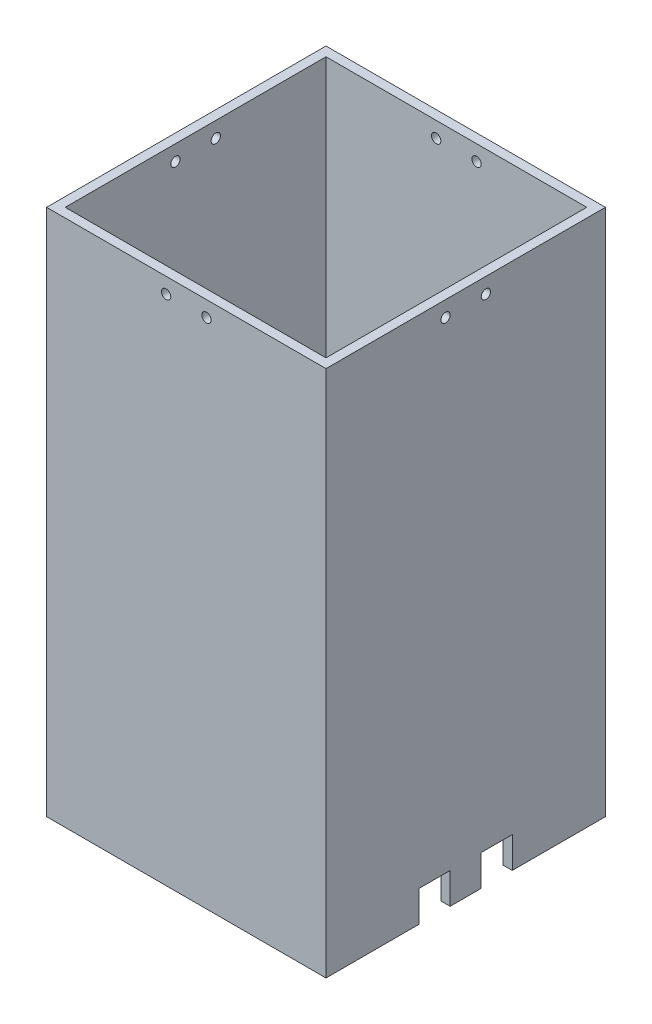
from build123d import *

# Parameters (mm, degrees)
SKETCH_1_W          = 90
SKETCH_1_H          = 90
SKETCH_1_W_2        = 84
SKETCH_1_H_2        = 84
EXTRUDE_1_DEPTH     = 170
CUT_EXTRUDE_1_REACH = 199.547
SKETCH_2_R          = 1.5
CUT_EXTRUDE_2_REACH = 199.547
SKETCH_3_R          = 1.5
CUT_EXTRUDE_3_REACH = 199.547
SKETCH_4_W          = 10
SKETCH_4_H          = 10


with BuildPart() as part:
    # Sketch 1 → Extrude 1 (new body)
    with BuildSketch(Plane(origin=(0, 0, 0), x_dir=(1, 0, 0), z_dir=(0, 1, 0))):
        Rectangle(SKETCH_1_W, SKETCH_1_H)
        Rectangle(SKETCH_1_W_2, SKETCH_1_H_2, mode=Mode.SUBTRACT)
    extrude(amount=EXTRUDE_1_DEPTH)

    # Cut-Extrude 1: up to this face of the body (flat: up to its plane)
    cut_extrude_1_end = Plane(part.part.faces().sort_by_distance((0, 85, -45))[0])
    # Sketch 2 → Cut-Extrude 1 (cut, up to the picked face)
    with BuildSketch(Plane.XY.offset(45), mode=Mode.PRIVATE) as cut_extrude_1_sk1:
        with Locations((6.5, 165)):
            Circle(SKETCH_2_R)
    cut_extrude_1_tool1 = split(extrude(cut_extrude_1_sk1.sketch, amount=-CUT_EXTRUDE_1_REACH, mode=Mode.PRIVATE), bisect_by=cut_extrude_1_end, keep=Keep.BOTH, mode=Mode.PRIVATE)
    # Sketch 2 → Cut-Extrude 1 (cut, up to the picked face)
    with BuildSketch(Plane.XY.offset(45), mode=Mode.PRIVATE) as cut_extrude_1_sk2:
        with Locations((-6.5, 165)):
            Circle(SKETCH_2_R)
    cut_extrude_1_tool2 = split(extrude(cut_extrude_1_sk2.sketch, amount=-CUT_EXTRUDE_1_REACH, mode=Mode.PRIVATE), bisect_by=cut_extrude_1_end, keep=Keep.BOTH, mode=Mode.PRIVATE)
    add(cut_extrude_1_tool1.solids().sort_by(Axis((6.5, 165, 45), (0, 0, -1)))[0], mode=Mode.SUBTRACT)
    add(cut_extrude_1_tool2.solids().sort_by(Axis((-6.5, 165, 45), (0, 0, -1)))[0], mode=Mode.SUBTRACT)

    # Cut-Extrude 2: up to this face of the body (flat: up to its plane)
    cut_extrude_2_end = Plane(part.part.faces().sort_by_distance((-45, 85, 0))[0])
    # Sketch 3 → Cut-Extrude 2 (cut, up to the picked face)
    with BuildSketch(Plane(origin=(45, 0, 0), x_dir=(0, 0, -1), z_dir=(1, 0, 0)), mode=Mode.PRIVATE) as cut_extrude_2_sk1:
        with Locations((6.5, 165)):
            Circle(SKETCH_3_R)
    cut_extrude_2_tool1 = split(extrude(cut_extrude_2_sk1.sketch, amount=-CUT_EXTRUDE_2_REACH, mode=Mode.PRIVATE), bisect_by=cut_extrude_2_end, keep=Keep.BOTH, mode=Mode.PRIVATE)
    # Sketch 3 → Cut-Extrude 2 (cut, up to the picked face)
    with BuildSketch(Plane(origin=(45, 0, 0), x_dir=(0, 0, -1), z_dir=(1, 0, 0)), mode=Mode.PRIVATE) as cut_extrude_2_sk2:
        with Locations((-6.5, 165)):
            Circle(SKETCH_3_R)
    cut_extrude_2_tool2 = split(extrude(cut_extrude_2_sk2.sketch, amount=-CUT_EXTRUDE_2_REACH, mode=Mode.PRIVATE), bisect_by=cut_extrude_2_end, keep=Keep.BOTH, mode=Mode.PRIVATE)
    add(cut_extrude_2_tool1.solids().sort_by(Axis((45, 165, -6.5), (-1, 0, 0)))[0], mode=Mode.SUBTRACT)
    add(cut_extrude_2_tool2.solids().sort_by(Axis((45, 165, 6.5), (-1, 0, 0)))[0], mode=Mode.SUBTRACT)

    # Cut-Extrude 3: up to this face of the body (flat: up to its plane)
    cut_extrude_3_end = Plane(part.part.faces().sort_by_distance((-45, 84.926011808, 0))[0])
    # Sketch 4 → Cut-Extrude 3 (cut, up to the picked face)
    with BuildSketch(Plane(origin=(45, 0, 0), x_dir=(0, 0, -1), z_dir=(1, 0, 0)), mode=Mode.PRIVATE) as cut_extrude_3_sk1:
        with Locations((10, 5)):
            Rectangle(SKETCH_4_W, SKETCH_4_H)
    cut_extrude_3_tool1 = split(extrude(cut_extrude_3_sk1.sketch, amount=-CUT_EXTRUDE_3_REACH, mode=Mode.PRIVATE), bisect_by=cut_extrude_3_end, keep=Keep.BOTH, mode=Mode.PRIVATE)
    # Sketch 4 → Cut-Extrude 3 (cut, up to the picked face)
    with BuildSketch(Plane(origin=(45, 0, 0), x_dir=(0, 0, -1), z_dir=(1, 0, 0)), mode=Mode.PRIVATE) as cut_extrude_3_sk2:
        with Locations((-10, 5)):
            Rectangle(SKETCH_4_W, SKETCH_4_H)
    cut_extrude_3_tool2 = split(extrude(cut_extrude_3_sk2.sketch, amount=-CUT_EXTRUDE_3_REACH, mode=Mode.PRIVATE), bisect_by=cut_extrude_3_end, keep=Keep.BOTH, mode=Mode.PRIVATE)
    add(cut_extrude_3_tool1.solids().sort_by(Axis((45, 5, -10), (-1, 0, 0)))[0], mode=Mode.SUBTRACT)
    add(cut_extrude_3_tool2.solids().sort_by(Axis((45, 5, 10), (-1, 0, 0)))[0], mode=Mode.SUBTRACT)


solid = part.part
